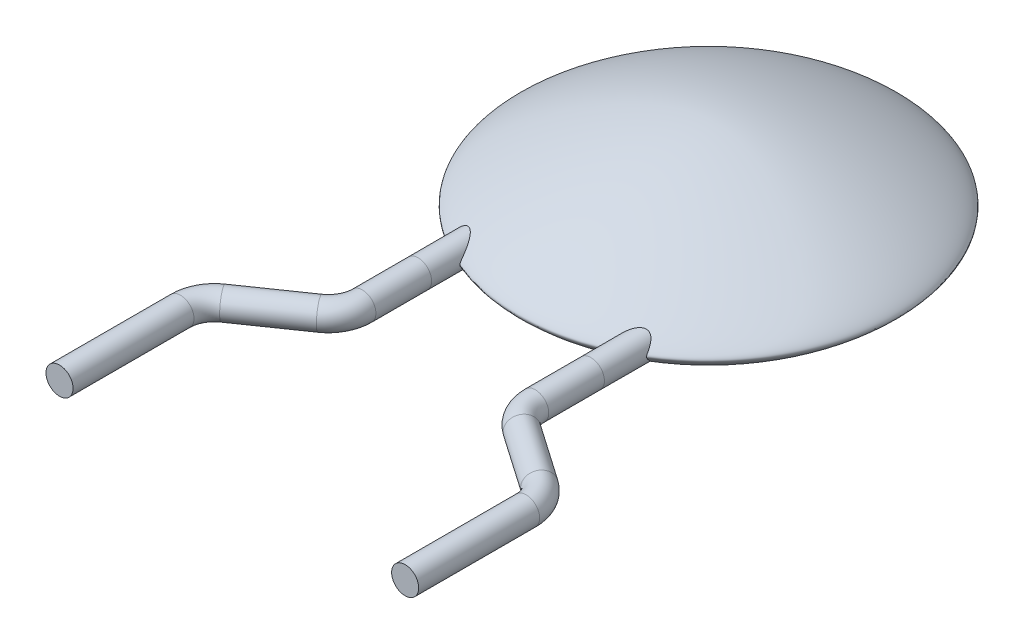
ISO-10303-21;
HEADER;
FILE_DESCRIPTION(('STEP AP214'),'2;1');
FILE_NAME('part.step','',(''),(''),'','','');
FILE_SCHEMA(('AUTOMOTIVE_DESIGN { 1 0 10303 214 1 1 1 1 }'));
ENDSEC;
DATA;
#1=APPLICATION_CONTEXT('core data for automotive mechanical design processes');
#2=APPLICATION_PROTOCOL_DEFINITION('international standard','automotive_design',2000,#1);
#3=PRODUCT_CONTEXT('',#1,'mechanical');
#4=PRODUCT('Part','Part','',(#3));
#5=PRODUCT_RELATED_PRODUCT_CATEGORY('part','',(#4));
#6=PRODUCT_DEFINITION_FORMATION('','',#4);
#7=PRODUCT_DEFINITION_CONTEXT('part definition',#1,'design');
#8=PRODUCT_DEFINITION('design','',#6,#7);
#9=PRODUCT_DEFINITION_SHAPE('','',#8);
#10=(LENGTH_UNIT() NAMED_UNIT(*) SI_UNIT(.MILLI.,.METRE.));
#11=(NAMED_UNIT(*) PLANE_ANGLE_UNIT() SI_UNIT($,.RADIAN.));
#12=(NAMED_UNIT(*) SI_UNIT($,.STERADIAN.) SOLID_ANGLE_UNIT());
#13=UNCERTAINTY_MEASURE_WITH_UNIT(LENGTH_MEASURE(1.E-05),#10,'distance_accuracy_value','');
#14=(GEOMETRIC_REPRESENTATION_CONTEXT(3) GLOBAL_UNCERTAINTY_ASSIGNED_CONTEXT((#13)) GLOBAL_UNIT_ASSIGNED_CONTEXT((#10,
#11,#12)) REPRESENTATION_CONTEXT('',''));
#15=CARTESIAN_POINT('',(0.,0.,0.));
#16=DIRECTION('',(0.,0.,1.));
#17=DIRECTION('',(1.,0.,0.));
#18=AXIS2_PLACEMENT_3D('',#15,#16,#17);
#19=CARTESIAN_POINT('',(0.,1.05,0.));
#20=CARTESIAN_POINT('',(-1.17248497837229,1.04999999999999,0.));
#21=CARTESIAN_POINT('',(-2.8,0.16193282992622,0.));
#22=CARTESIAN_POINT('',(-2.8,-0.16193282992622,0.));
#23=CARTESIAN_POINT('',(-1.2956675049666,-1.05,0.));
#24=CARTESIAN_POINT('',(0.,-1.05,0.));
#25=B_SPLINE_CURVE_WITH_KNOTS('',3,(#19,#20,#21,#22,#23,#24),.UNSPECIFIED.,.F.,.F.,(4,2,4),(0.,
0.5,1.),.UNSPECIFIED.);
#26=CARTESIAN_POINT('',(0.,1.05,0.));
#27=DIRECTION('',(0.,1.,0.));
#28=AXIS1_PLACEMENT('',#26,#27);
#29=SURFACE_OF_REVOLUTION('',#25,#28);
#30=CARTESIAN_POINT('',(1.47000000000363,0.,2.38308623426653));
#31=CARTESIAN_POINT('',(1.46999967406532,0.00371449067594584,2.3830677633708));
#32=CARTESIAN_POINT('',(1.46989144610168,0.007420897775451,2.38215189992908));
#33=CARTESIAN_POINT('',(1.46947322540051,0.0151314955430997,2.3792964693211));
#34=CARTESIAN_POINT('',(1.4691278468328,0.0190516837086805,2.37719144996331));
#35=CARTESIAN_POINT('',(1.46825798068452,0.0266046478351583,2.37252553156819));
#36=CARTESIAN_POINT('',(1.46773279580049,0.0302362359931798,2.36996287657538));
#37=CARTESIAN_POINT('',(1.46605837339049,0.0400254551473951,2.36251611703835));
#38=CARTESIAN_POINT('',(1.46474134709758,0.0459528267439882,2.35737566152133));
#39=CARTESIAN_POINT('',(1.46166454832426,0.0574419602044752,2.34682128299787));
#40=CARTESIAN_POINT('',(1.45990392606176,0.0630029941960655,2.34140685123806));
#41=CARTESIAN_POINT('',(1.45395505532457,0.0793507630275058,2.32499898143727));
#42=CARTESIAN_POINT('',(1.44910577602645,0.0897700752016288,2.31386955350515));
#43=CARTESIAN_POINT('',(1.43739431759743,0.110074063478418,2.29206232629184));
#44=CARTESIAN_POINT('',(1.43052219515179,0.119955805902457,2.28138706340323));
#45=CARTESIAN_POINT('',(1.41430596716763,0.139041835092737,2.2615025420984));
#46=CARTESIAN_POINT('',(1.40498460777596,0.148251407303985,2.25228098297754));
#47=CARTESIAN_POINT('',(1.38506181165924,0.163974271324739,2.23832270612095));
#48=CARTESIAN_POINT('',(1.37501084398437,0.170671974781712,2.23307313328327));
#49=CARTESIAN_POINT('',(1.35835411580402,0.179538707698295,2.22790199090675));
#50=CARTESIAN_POINT('',(1.35249504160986,0.182311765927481,2.2266295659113));
#51=CARTESIAN_POINT('',(1.34041669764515,0.187306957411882,2.22518087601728));
#52=CARTESIAN_POINT('',(1.33419785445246,0.189529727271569,2.22500333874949));
#53=CARTESIAN_POINT('',(1.32233866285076,0.193118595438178,2.2257422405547));
#54=CARTESIAN_POINT('',(1.31671079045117,0.194552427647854,2.22653934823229));
#55=CARTESIAN_POINT('',(1.30551924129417,0.196904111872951,2.22895871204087));
#56=CARTESIAN_POINT('',(1.29995570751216,0.197820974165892,2.23058253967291));
#57=CARTESIAN_POINT('',(1.28005556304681,0.200274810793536,2.23777048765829));
#58=CARTESIAN_POINT('',(1.26629751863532,0.200362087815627,2.24542884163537));
#59=CARTESIAN_POINT('',(1.24324630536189,0.19848203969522,2.26155224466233));
#60=CARTESIAN_POINT('',(1.23359562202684,0.196883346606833,2.26962107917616));
#61=CARTESIAN_POINT('',(1.21542939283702,0.192633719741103,2.2867414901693));
#62=CARTESIAN_POINT('',(1.20691674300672,0.189980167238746,2.29579547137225));
#63=CARTESIAN_POINT('',(1.18374390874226,0.181178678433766,2.3227804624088));
#64=CARTESIAN_POINT('',(1.17034619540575,0.174021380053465,2.34144767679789));
#65=CARTESIAN_POINT('',(1.14616991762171,0.157723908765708,2.37960538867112));
#66=CARTESIAN_POINT('',(1.13540091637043,0.148576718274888,2.39909859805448));
#67=CARTESIAN_POINT('',(1.11509610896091,0.127449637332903,2.44037694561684));
#68=CARTESIAN_POINT('',(1.10581030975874,0.115272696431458,2.46218689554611));
#69=CARTESIAN_POINT('',(1.09389818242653,0.0951199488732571,2.49440971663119));
#70=CARTESIAN_POINT('',(1.09026576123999,0.0880944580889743,2.50505995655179));
#71=CARTESIAN_POINT('',(1.08371435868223,0.0732419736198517,2.52600950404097));
#72=CARTESIAN_POINT('',(1.08079413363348,0.0654164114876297,2.53630939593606));
#73=CARTESIAN_POINT('',(1.07695482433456,0.0524892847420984,2.55144772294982));
#74=CARTESIAN_POINT('',(1.07573914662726,0.047829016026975,2.5565842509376));
#75=CARTESIAN_POINT('',(1.07358552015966,0.0380358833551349,2.56641055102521));
#76=CARTESIAN_POINT('',(1.07264620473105,0.0329055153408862,2.57110244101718));
#77=CARTESIAN_POINT('',(1.07134379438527,0.0234759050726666,2.57832353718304));
#78=CARTESIAN_POINT('',(1.07089242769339,0.0193812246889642,2.58108151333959));
#79=CARTESIAN_POINT('',(1.07043460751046,0.013287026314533,2.5841588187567));
#80=CARTESIAN_POINT('',(1.07032479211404,0.011535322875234,2.58493876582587));
#81=CARTESIAN_POINT('',(1.07014974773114,0.00794304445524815,2.58624351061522));
#82=CARTESIAN_POINT('',(1.07008425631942,0.00610306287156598,2.58676980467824));
#83=CARTESIAN_POINT('',(1.07001359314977,0.00275389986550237,2.58735975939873));
#84=CARTESIAN_POINT('',(1.0699984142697,0.00125960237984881,2.58749904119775));
#85=CARTESIAN_POINT('',(1.07000185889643,-0.0017270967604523,2.58747686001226));
#86=CARTESIAN_POINT('',(1.07002052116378,-0.00321949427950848,2.58731505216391));
#87=CARTESIAN_POINT('',(1.07010547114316,-0.00684279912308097,2.58665719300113));
#88=CARTESIAN_POINT('',(1.07018981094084,-0.00894936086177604,2.58604106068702));
#89=CARTESIAN_POINT('',(1.07041594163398,-0.0130559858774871,2.58451471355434));
#90=CARTESIAN_POINT('',(1.0705580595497,-0.0150553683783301,2.58360283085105));
#91=CARTESIAN_POINT('',(1.07118369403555,-0.0223954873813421,2.57982222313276));
#92=CARTESIAN_POINT('',(1.07182673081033,-0.0273977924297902,2.57634290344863));
#93=CARTESIAN_POINT('',(1.07337429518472,-0.0368965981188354,2.56882704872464));
#94=CARTESIAN_POINT('',(1.07427990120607,-0.0413909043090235,2.56478825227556));
#95=CARTESIAN_POINT('',(1.07689696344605,-0.0525418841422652,2.55395847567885));
#96=CARTESIAN_POINT('',(1.07877067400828,-0.0589347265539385,2.54693376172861));
#97=CARTESIAN_POINT('',(1.08296877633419,-0.0711381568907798,2.53251689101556));
#98=CARTESIAN_POINT('',(1.08529412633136,-0.0769474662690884,2.52512397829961));
#99=CARTESIAN_POINT('',(1.09289308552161,-0.0937284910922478,2.50260626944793));
#100=CARTESIAN_POINT('',(1.09878018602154,-0.104017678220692,2.48718145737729));
#101=CARTESIAN_POINT('',(1.11571571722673,-0.128553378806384,2.44757864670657));
#102=CARTESIAN_POINT('',(1.1278210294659,-0.141858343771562,2.42325865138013));
#103=CARTESIAN_POINT('',(1.14889420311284,-0.159420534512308,2.38744991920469));
#104=CARTESIAN_POINT('',(1.15638184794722,-0.164864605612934,2.37565457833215));
#105=CARTESIAN_POINT('',(1.17246484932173,-0.174862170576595,2.3524579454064));
#106=CARTESIAN_POINT('',(1.18105958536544,-0.179416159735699,2.34105643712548));
#107=CARTESIAN_POINT('',(1.20245860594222,-0.188719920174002,2.31542838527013));
#108=CARTESIAN_POINT('',(1.21573949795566,-0.193087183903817,2.30143076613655));
#109=CARTESIAN_POINT('',(1.23785298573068,-0.197541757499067,2.28227030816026));
#110=CARTESIAN_POINT('',(1.24563867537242,-0.198677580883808,2.27616094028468));
#111=CARTESIAN_POINT('',(1.2619611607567,-0.200008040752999,2.26495020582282));
#112=CARTESIAN_POINT('',(1.27049599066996,-0.200205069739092,2.25984630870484));
#113=CARTESIAN_POINT('',(1.29106674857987,-0.199220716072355,2.24981534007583));
#114=CARTESIAN_POINT('',(1.30337730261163,-0.19760124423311,2.24541555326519));
#115=CARTESIAN_POINT('',(1.32200782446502,-0.193228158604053,2.24175942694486));
#116=CARTESIAN_POINT('',(1.32827702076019,-0.191432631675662,2.24103517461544));
#117=CARTESIAN_POINT('',(1.34064007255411,-0.187223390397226,2.24063623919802));
#118=CARTESIAN_POINT('',(1.34673393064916,-0.184809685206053,2.24096154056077));
#119=CARTESIAN_POINT('',(1.36333291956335,-0.177272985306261,2.24329652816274));
#120=CARTESIAN_POINT('',(1.37340387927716,-0.171541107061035,2.24645906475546));
#121=CARTESIAN_POINT('',(1.39679225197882,-0.155646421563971,2.25743180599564));
#122=CARTESIAN_POINT('',(1.4088013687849,-0.1447919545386,2.26684846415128));
#123=CARTESIAN_POINT('',(1.42758368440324,-0.12383576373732,2.28631127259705));
#124=CARTESIAN_POINT('',(1.43486726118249,-0.113858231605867,2.29606099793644));
#125=CARTESIAN_POINT('',(1.44731853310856,-0.0932863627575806,2.31620778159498));
#126=CARTESIAN_POINT('',(1.45248991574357,-0.0826931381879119,2.32660367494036));
#127=CARTESIAN_POINT('',(1.4584793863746,-0.0670758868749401,2.34112770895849));
#128=CARTESIAN_POINT('',(1.46007249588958,-0.062426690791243,2.3453582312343));
#129=CARTESIAN_POINT('',(1.46294836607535,-0.052877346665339,2.35370298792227));
#130=CARTESIAN_POINT('',(1.46422918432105,-0.0479758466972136,2.35781636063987));
#131=CARTESIAN_POINT('',(1.46647252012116,-0.037769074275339,2.3657990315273));
#132=CARTESIAN_POINT('',(1.46742991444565,-0.0324588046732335,2.36966368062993));
#133=CARTESIAN_POINT('',(1.46856250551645,-0.0240956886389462,2.37484731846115));
#134=CARTESIAN_POINT('',(1.46888858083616,-0.0212566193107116,2.37646649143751));
#135=CARTESIAN_POINT('',(1.46942805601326,-0.0154020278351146,2.37935633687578));
#136=CARTESIAN_POINT('',(1.46964161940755,-0.0123867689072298,2.38062751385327));
#137=CARTESIAN_POINT('',(1.46992461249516,-0.00623777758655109,2.38248569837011));
#138=CARTESIAN_POINT('',(1.47000027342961,-0.00311604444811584,2.3831017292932));
#139=CARTESIAN_POINT('',(1.47000000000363,0.,2.38308623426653));
#140=B_SPLINE_CURVE_WITH_KNOTS('',3,(#30,#31,#32,#33,#34,#35,#36,#37,#38,#39,#40,#41,#42,#43,
#44,#45,#46,#47,#48,#49,#50,#51,#52,#53,#54,#55,#56,#57,#58,#59,#60,#61,#62,#63,#64,#65,#66,#67,
#68,#69,#70,#71,#72,#73,#74,#75,#76,#77,#78,#79,#80,#81,#82,#83,#84,#85,#86,#87,#88,#89,#90,#91,
#92,#93,#94,#95,#96,#97,#98,#99,#100,#101,#102,#103,#104,#105,#106,#107,#108,#109,#110,#111,
#112,#113,#114,#115,#116,#117,#118,#119,#120,#121,#122,#123,#124,#125,#126,#127,#128,#129,#130,
#131,#132,#133,#134,#135,#136,#137,#138,#139),.UNSPECIFIED.,.T.,.F.,(4,2,2,2,2,2,2,2,2,2,2,2,2,
2,2,2,2,2,2,2,2,2,2,2,2,2,2,2,2,2,2,2,2,2,2,2,2,2,2,2,2,2,2,2,2,2,2,2,2,2,2,2,2,2,4),(0.,
0.0111621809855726,0.0245119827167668,0.0379141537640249,0.0617319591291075,0.0855957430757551,
0.13345252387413,0.181548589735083,0.22921287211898,0.268113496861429,0.287822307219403,
0.307508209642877,0.325007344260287,0.342539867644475,0.388830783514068,0.426752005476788,
0.464767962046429,0.536579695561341,0.608648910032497,0.688322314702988,0.728092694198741,
0.767793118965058,0.788895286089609,0.809891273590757,0.824662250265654,0.830411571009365,
0.836126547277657,0.840601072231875,0.845080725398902,0.851634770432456,0.858226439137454,
0.876465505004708,0.894780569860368,0.92375500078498,0.952791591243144,1.01102420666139,
1.1013290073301,1.14625445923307,1.19115484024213,1.25006902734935,1.27985687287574,
1.3095687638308,1.34832979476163,1.36790587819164,1.38748167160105,1.42294649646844,
1.47812988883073,1.52519474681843,1.57217708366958,1.59162290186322,1.61118675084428,
1.63104737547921,1.64088142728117,1.65070114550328,1.66006497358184),.UNSPECIFIED.);
#141=CARTESIAN_POINT('',(1.47000000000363,0.,2.38308623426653));
#142=VERTEX_POINT('',#141);
#143=EDGE_CURVE('E11',#142,#142,#140,.T.);
#144=ORIENTED_EDGE('',*,*,#143,.F.);
#145=EDGE_LOOP('',(#144));
#146=FACE_BOUND('',#145,.T.);
#147=CARTESIAN_POINT('',(-1.07000000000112,0.,2.58748913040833));
#148=CARTESIAN_POINT('',(-1.07000007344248,0.0035103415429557,2.5874711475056));
#149=CARTESIAN_POINT('',(-1.0700971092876,0.00702169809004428,2.58662128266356));
#150=CARTESIAN_POINT('',(-1.07041537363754,0.0132211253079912,2.58427957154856));
#151=CARTESIAN_POINT('',(-1.07061950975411,0.0159572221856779,2.58288155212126));
#152=CARTESIAN_POINT('',(-1.07111315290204,0.0212332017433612,2.57975653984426));
#153=CARTESIAN_POINT('',(-1.07140274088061,0.0237728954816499,2.5780292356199));
#154=CARTESIAN_POINT('',(-1.07226853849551,0.0303236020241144,2.57315774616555));
#155=CARTESIAN_POINT('',(-1.07290725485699,0.0341892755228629,2.56983549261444));
#156=CARTESIAN_POINT('',(-1.07434210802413,0.0416192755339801,2.56289663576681));
#157=CARTESIAN_POINT('',(-1.07513856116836,0.0451829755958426,2.55927944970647));
#158=CARTESIAN_POINT('',(-1.07773991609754,0.0555649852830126,2.54812605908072));
#159=CARTESIAN_POINT('',(-1.07975131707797,0.0620379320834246,2.54031912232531));
#160=CARTESIAN_POINT('',(-1.08525949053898,0.0772174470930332,2.52073450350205));
#161=CARTESIAN_POINT('',(-1.08901458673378,0.0855886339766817,2.50877634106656));
#162=CARTESIAN_POINT('',(-1.09740659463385,0.101446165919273,2.48456948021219));
#163=CARTESIAN_POINT('',(-1.1020450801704,0.108930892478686,2.47232029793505));
#164=CARTESIAN_POINT('',(-1.11722017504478,0.130250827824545,2.4354907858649));
#165=CARTESIAN_POINT('',(-1.12903259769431,0.142993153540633,2.41077014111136));
#166=CARTESIAN_POINT('',(-1.15111463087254,0.161189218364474,2.3716400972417));
#167=CARTESIAN_POINT('',(-1.16019345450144,0.167548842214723,2.35696443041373));
#168=CARTESIAN_POINT('',(-1.1800307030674,0.178990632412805,2.32826965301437));
#169=CARTESIAN_POINT('',(-1.19078525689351,0.184075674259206,2.31424912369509));
#170=CARTESIAN_POINT('',(-1.20970824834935,0.190843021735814,2.29283846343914));
#171=CARTESIAN_POINT('',(-1.21719947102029,0.193073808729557,2.28503256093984));
#172=CARTESIAN_POINT('',(-1.23305361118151,0.196728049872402,2.27017658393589));
#173=CARTESIAN_POINT('',(-1.24141557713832,0.19815237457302,2.2631257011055));
#174=CARTESIAN_POINT('',(-1.26267378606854,0.200246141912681,2.24767217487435));
#175=CARTESIAN_POINT('',(-1.27607419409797,0.200411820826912,2.23979865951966));
#176=CARTESIAN_POINT('',(-1.29575451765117,0.198413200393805,2.23197621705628));
#177=CARTESIAN_POINT('',(-1.30141339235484,0.197603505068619,2.23011909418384));
#178=CARTESIAN_POINT('',(-1.31283467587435,0.195445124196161,2.22724673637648));
#179=CARTESIAN_POINT('',(-1.3185968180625,0.194097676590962,2.22622958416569));
#180=CARTESIAN_POINT('',(-1.33008757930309,0.190853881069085,2.22512623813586));
#181=CARTESIAN_POINT('',(-1.33581591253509,0.188954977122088,2.22504445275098));
#182=CARTESIAN_POINT('',(-1.34702183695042,0.184672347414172,2.22581464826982));
#183=CARTESIAN_POINT('',(-1.35249926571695,0.182288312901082,2.22666722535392));
#184=CARTESIAN_POINT('',(-1.37002044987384,0.1737242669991,2.23089411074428));
#185=CARTESIAN_POINT('',(-1.38120637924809,0.166681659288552,2.23611093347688));
#186=CARTESIAN_POINT('',(-1.39868029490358,0.15341313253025,2.24759147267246));
#187=CARTESIAN_POINT('',(-1.40550348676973,0.147367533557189,2.25334470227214));
#188=CARTESIAN_POINT('',(-1.41791099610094,0.134902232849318,2.26577636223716));
#189=CARTESIAN_POINT('',(-1.42349014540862,0.128481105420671,2.27245847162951));
#190=CARTESIAN_POINT('',(-1.43761563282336,0.110135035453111,2.29190207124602));
#191=CARTESIAN_POINT('',(-1.44496408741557,0.0979173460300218,2.30524975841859));
#192=CARTESIAN_POINT('',(-1.45393400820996,0.0788432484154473,2.32535242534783));
#193=CARTESIAN_POINT('',(-1.45658005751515,0.0723681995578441,2.3320593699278));
#194=CARTESIAN_POINT('',(-1.46122101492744,0.0590332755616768,2.3453124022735));
#195=CARTESIAN_POINT('',(-1.46321698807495,0.0521740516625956,2.35185873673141));
#196=CARTESIAN_POINT('',(-1.46549465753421,0.0422994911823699,2.36042809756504));
#197=CARTESIAN_POINT('',(-1.4660657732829,0.0395751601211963,2.36271014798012));
#198=CARTESIAN_POINT('',(-1.4671106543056,0.0339931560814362,2.36714635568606));
#199=CARTESIAN_POINT('',(-1.46758417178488,0.0311351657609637,2.36930017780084));
#200=CARTESIAN_POINT('',(-1.46842632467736,0.025218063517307,2.37340341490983));
#201=CARTESIAN_POINT('',(-1.46879397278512,0.0221573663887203,2.37535080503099));
#202=CARTESIAN_POINT('',(-1.46939989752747,0.0158115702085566,2.3788471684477));
#203=CARTESIAN_POINT('',(-1.46963868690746,0.012527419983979,2.38039770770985));
#204=CARTESIAN_POINT('',(-1.469931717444,0.00601419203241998,2.38247631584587));
#205=CARTESIAN_POINT('',(-1.47000501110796,0.00282782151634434,2.38310651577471));
#206=CARTESIAN_POINT('',(-1.46999436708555,-0.00353345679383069,2.38306083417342));
#207=CARTESIAN_POINT('',(-1.46991006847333,-0.00670832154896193,2.38238195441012));
#208=CARTESIAN_POINT('',(-1.46956313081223,-0.0138448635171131,2.38012817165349));
#209=CARTESIAN_POINT('',(-1.46925001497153,-0.0177116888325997,2.37832858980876));
#210=CARTESIAN_POINT('',(-1.46844336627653,-0.0251832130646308,2.37425653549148));
#211=CARTESIAN_POINT('',(-1.4679489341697,-0.0287864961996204,2.37198173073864));
#212=CARTESIAN_POINT('',(-1.46639794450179,-0.0382737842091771,2.36549642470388));
#213=CARTESIAN_POINT('',(-1.46519107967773,-0.0439696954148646,2.36105420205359));
#214=CARTESIAN_POINT('',(-1.46236424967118,-0.0550296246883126,2.35189177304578));
#215=CARTESIAN_POINT('',(-1.46074350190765,-0.0603929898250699,2.34717105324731));
#216=CARTESIAN_POINT('',(-1.45526780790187,-0.0761632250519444,2.33284257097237));
#217=CARTESIAN_POINT('',(-1.45080312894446,-0.0862293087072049,2.32308526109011));
#218=CARTESIAN_POINT('',(-1.44008619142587,-0.105803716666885,2.30396115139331));
#219=CARTESIAN_POINT('',(-1.43383178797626,-0.115311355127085,2.29459483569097));
#220=CARTESIAN_POINT('',(-1.4192140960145,-0.133691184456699,2.27704162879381));
#221=CARTESIAN_POINT('',(-1.410864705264,-0.142567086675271,2.2688475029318));
#222=CARTESIAN_POINT('',(-1.39194139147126,-0.158985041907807,2.25512818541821));
#223=CARTESIAN_POINT('',(-1.38149964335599,-0.166571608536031,2.24948998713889));
#224=CARTESIAN_POINT('',(-1.36404222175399,-0.176641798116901,2.24386275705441));
#225=CARTESIAN_POINT('',(-1.35787575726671,-0.179797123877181,2.24245903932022));
#226=CARTESIAN_POINT('',(-1.34511579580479,-0.185488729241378,2.24081779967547));
#227=CARTESIAN_POINT('',(-1.33852288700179,-0.188025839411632,2.24057870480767));
#228=CARTESIAN_POINT('',(-1.32599435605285,-0.192100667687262,2.24127714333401));
#229=CARTESIAN_POINT('',(-1.32007765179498,-0.19372293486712,2.24207354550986));
#230=CARTESIAN_POINT('',(-1.30828988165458,-0.196393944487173,2.24453539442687));
#231=CARTESIAN_POINT('',(-1.30241892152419,-0.197441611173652,2.24620245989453));
#232=CARTESIAN_POINT('',(-1.28173036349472,-0.200220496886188,2.25350546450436));
#233=CARTESIAN_POINT('',(-1.26744793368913,-0.200412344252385,2.26124858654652));
#234=CARTESIAN_POINT('',(-1.24367210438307,-0.19855059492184,2.27745974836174));
#235=CARTESIAN_POINT('',(-1.23378903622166,-0.196930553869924,2.28548682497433));
#236=CARTESIAN_POINT('',(-1.21515593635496,-0.192567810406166,2.30252755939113));
#237=CARTESIAN_POINT('',(-1.20640842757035,-0.189822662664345,2.31154333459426));
#238=CARTESIAN_POINT('',(-1.18312391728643,-0.180872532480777,2.33781449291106));
#239=CARTESIAN_POINT('',(-1.16974665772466,-0.173679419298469,2.35574476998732));
#240=CARTESIAN_POINT('',(-1.14553449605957,-0.157230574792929,2.39241632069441));
#241=CARTESIAN_POINT('',(-1.13471256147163,-0.147964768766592,2.41116118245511));
#242=CARTESIAN_POINT('',(-1.11441541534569,-0.126617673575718,2.45059864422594));
#243=CARTESIAN_POINT('',(-1.10516153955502,-0.114353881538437,2.47130911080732));
#244=CARTESIAN_POINT('',(-1.09332884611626,-0.0940585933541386,2.50176087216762));
#245=CARTESIAN_POINT('',(-1.08973506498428,-0.0870050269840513,2.51177494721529));
#246=CARTESIAN_POINT('',(-1.08326526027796,-0.0720900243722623,2.53142049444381));
#247=CARTESIAN_POINT('',(-1.08038778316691,-0.0642302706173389,2.54105270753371));
#248=CARTESIAN_POINT('',(-1.0769994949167,-0.0525524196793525,2.5537225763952));
#249=CARTESIAN_POINT('',(-1.07612835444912,-0.0492540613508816,2.55714222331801));
#250=CARTESIAN_POINT('',(-1.07451779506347,-0.0424169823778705,2.56380074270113));
#251=CARTESIAN_POINT('',(-1.07377897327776,-0.038877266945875,2.56703875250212));
#252=CARTESIAN_POINT('',(-1.07245180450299,-0.0314491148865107,2.57323383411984));
#253=CARTESIAN_POINT('',(-1.07186542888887,-0.0275569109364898,2.57618694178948));
#254=CARTESIAN_POINT('',(-1.07089676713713,-0.0193698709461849,2.58148352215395));
#255=CARTESIAN_POINT('',(-1.07051327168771,-0.0150776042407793,2.58383056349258));
#256=CARTESIAN_POINT('',(-1.07009863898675,-0.00708540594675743,2.58667789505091));
#257=CARTESIAN_POINT('',(-1.06999992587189,-0.00354322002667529,2.58750728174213));
#258=CARTESIAN_POINT('',(-1.07000000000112,0.,2.58748913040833));
#259=B_SPLINE_CURVE_WITH_KNOTS('',3,(#147,#148,#149,#150,#151,#152,#153,#154,#155,#156,#157,
#158,#159,#160,#161,#162,#163,#164,#165,#166,#167,#168,#169,#170,#171,#172,#173,#174,#175,#176,
#177,#178,#179,#180,#181,#182,#183,#184,#185,#186,#187,#188,#189,#190,#191,#192,#193,#194,#195,
#196,#197,#198,#199,#200,#201,#202,#203,#204,#205,#206,#207,#208,#209,#210,#211,#212,#213,#214,
#215,#216,#217,#218,#219,#220,#221,#222,#223,#224,#225,#226,#227,#228,#229,#230,#231,#232,#233,
#234,#235,#236,#237,#238,#239,#240,#241,#242,#243,#244,#245,#246,#247,#248,#249,#250,#251,#252,
#253,#254,#255,#256,#257,#258),.UNSPECIFIED.,.T.,.F.,(4,2,2,2,2,2,2,2,2,2,2,2,2,2,2,2,2,2,2,2,2,
2,2,2,2,2,2,2,2,2,2,2,2,2,2,2,2,2,2,2,2,2,2,2,2,2,2,2,2,2,2,2,2,2,2,4),(0.,0.010546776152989,
0.019771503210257,0.0290049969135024,0.0443819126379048,0.0597899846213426,0.0907492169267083,
0.135892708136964,0.181117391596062,0.271348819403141,0.326439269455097,0.381404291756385,
0.414466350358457,0.447492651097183,0.493269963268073,0.511231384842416,0.529151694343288,
0.54715642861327,0.565172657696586,0.606928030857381,0.639155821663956,0.671515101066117,
0.729767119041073,0.758828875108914,0.787842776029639,0.798637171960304,0.809458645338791,
0.820377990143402,0.831253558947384,0.840794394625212,0.850357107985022,0.863138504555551,
0.875984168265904,0.897909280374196,0.919876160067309,0.963890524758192,1.00795786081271,
1.05174025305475,1.09333245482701,1.11441723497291,1.13547352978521,1.15393946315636,
1.17243985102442,1.22019892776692,1.25857921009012,1.29704335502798,1.36716149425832,
1.43762816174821,1.51470036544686,1.55296795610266,1.59115724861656,1.60564057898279,
1.62018770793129,1.63491452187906,1.64955253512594,1.66019809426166),.UNSPECIFIED.);
#260=CARTESIAN_POINT('',(-1.07000000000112,0.,2.58748913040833));
#261=VERTEX_POINT('',#260);
#262=EDGE_CURVE('E44',#261,#261,#259,.T.);
#263=ORIENTED_EDGE('',*,*,#262,.F.);
#264=EDGE_LOOP('',(#263));
#265=FACE_BOUND('',#264,.T.);
#266=CARTESIAN_POINT('',(0.,-1.05,0.));
#267=VERTEX_POINT('',#266);
#268=VERTEX_LOOP('',#267);
#269=FACE_BOUND('',#268,.T.);
#270=CARTESIAN_POINT('',(0.,1.05,0.));
#271=VERTEX_POINT('',#270);
#272=VERTEX_LOOP('',#271);
#273=FACE_BOUND('',#272,.T.);
#274=ADVANCED_FACE('F32',(#146,#265,#269,#273),#29,.F.);
#275=CARTESIAN_POINT('',(-1.27,0.,-500000.));
#276=DIRECTION('',(0.,0.,1.));
#277=DIRECTION('',(1.,0.,0.));
#278=AXIS2_PLACEMENT_3D('',#275,#276,#277);
#279=CYLINDRICAL_SURFACE('',#278,0.2);
#280=ORIENTED_EDGE('',*,*,#262,.T.);
#281=EDGE_LOOP('',(#280));
#282=FACE_BOUND('',#281,.T.);
#283=CARTESIAN_POINT('',(-1.27,0.,3.));
#284=DIRECTION('',(0.,0.,1.));
#285=DIRECTION('',(1.,0.,0.));
#286=AXIS2_PLACEMENT_3D('',#283,#284,#285);
#287=CIRCLE('',#286,0.199);
#288=CARTESIAN_POINT('',(-1.071,0.,3.));
#289=VERTEX_POINT('',#288);
#290=EDGE_CURVE('E63',#289,#289,#287,.T.);
#291=ORIENTED_EDGE('',*,*,#290,.F.);
#292=EDGE_LOOP('',(#291));
#293=FACE_BOUND('',#292,.T.);
#294=ADVANCED_FACE('F52',(#282,#293),#279,.T.);
#295=CARTESIAN_POINT('',(1.27,0.,-500000.));
#296=DIRECTION('',(0.,0.,1.));
#297=DIRECTION('',(1.,0.,0.));
#298=AXIS2_PLACEMENT_3D('',#295,#296,#297);
#299=CYLINDRICAL_SURFACE('',#298,0.2);
#300=ORIENTED_EDGE('',*,*,#143,.T.);
#301=EDGE_LOOP('',(#300));
#302=FACE_BOUND('',#301,.T.);
#303=CARTESIAN_POINT('',(1.27,0.,3.));
#304=DIRECTION('',(0.,0.,1.));
#305=DIRECTION('',(-1.,0.,0.));
#306=AXIS2_PLACEMENT_3D('',#303,#304,#305);
#307=CIRCLE('',#306,0.199);
#308=CARTESIAN_POINT('',(1.071,0.,3.));
#309=VERTEX_POINT('',#308);
#310=EDGE_CURVE('E66',#309,#309,#307,.T.);
#311=ORIENTED_EDGE('',*,*,#310,.F.);
#312=EDGE_LOOP('',(#311));
#313=FACE_BOUND('',#312,.T.);
#314=ADVANCED_FACE('F57',(#302,#313),#299,.T.);
#315=CARTESIAN_POINT('',(-2.54,0.,5.22237451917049));
#316=DIRECTION('',(0.,0.,1.));
#317=DIRECTION('',(1.,0.,0.));
#318=AXIS2_PLACEMENT_3D('',#315,#316,#317);
#319=CYLINDRICAL_SURFACE('',#318,0.199);
#320=CARTESIAN_POINT('',(-2.54,0.,5.22237451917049));
#321=DIRECTION('',(0.,0.,1.));
#322=DIRECTION('',(1.,0.,0.));
#323=AXIS2_PLACEMENT_3D('',#320,#321,#322);
#324=CIRCLE('',#323,0.199);
#325=CARTESIAN_POINT('',(-2.739,0.,5.22237451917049));
#326=VERTEX_POINT('',#325);
#327=EDGE_CURVE('E96',#326,#326,#324,.T.);
#328=ORIENTED_EDGE('',*,*,#327,.T.);
#329=EDGE_LOOP('',(#328));
#330=FACE_BOUND('',#329,.T.);
#331=CARTESIAN_POINT('',(-2.54,0.,7.));
#332=DIRECTION('',(0.,0.,1.));
#333=DIRECTION('',(1.,0.,0.));
#334=AXIS2_PLACEMENT_3D('',#331,#332,#333);
#335=CIRCLE('',#334,0.199);
#336=CARTESIAN_POINT('',(-2.341,0.,7.));
#337=VERTEX_POINT('',#336);
#338=EDGE_CURVE('E94',#337,#337,#335,.T.);
#339=ORIENTED_EDGE('',*,*,#338,.F.);
#340=EDGE_LOOP('',(#339));
#341=FACE_BOUND('',#340,.T.);
#342=ADVANCED_FACE('F132',(#330,#341),#319,.T.);
#343=CARTESIAN_POINT('',(-2.04,0.,5.22237451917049));
#344=DIRECTION('',(0.,1.,0.));
#345=DIRECTION('',(0.,0.,1.));
#346=AXIS2_PLACEMENT_3D('',#343,#344,#345);
#347=TOROIDAL_SURFACE('',#346,0.500000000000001,0.199);
#348=CARTESIAN_POINT('',(-2.32486617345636,0.,4.81145936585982));
#349=DIRECTION('',(-0.821830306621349,0.,0.569732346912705));
#350=DIRECTION('',(0.569732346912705,0.,0.821830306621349));
#351=AXIS2_PLACEMENT_3D('',#348,#349,#350);
#352=CIRCLE('',#351,0.199);
#353=CARTESIAN_POINT('',(-2.43824291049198,0.,4.64791513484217));
#354=VERTEX_POINT('',#353);
#355=EDGE_CURVE('E101',#354,#354,#352,.T.);
#356=CARTESIAN_POINT('',(-2.04,0.,5.22237451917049));
#357=DIRECTION('',(0.,1.,0.));
#358=DIRECTION('',(0.,0.,1.));
#359=AXIS2_PLACEMENT_3D('',#356,#357,#358);
#360=CIRCLE('',#359,0.699000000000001);
#361=EDGE_CURVE('',#354,#326,#360,.T.);
#362=ORIENTED_EDGE('',*,*,#355,.T.);
#363=ORIENTED_EDGE('',*,*,#327,.F.);
#364=ORIENTED_EDGE('',*,*,#361,.T.);
#365=ORIENTED_EDGE('',*,*,#361,.F.);
#366=EDGE_LOOP('',(#362,#364,#363,#365));
#367=FACE_BOUND('',#366,.T.);
#368=ADVANCED_FACE('F129',(#367),#347,.T.);
#369=CARTESIAN_POINT('',(-1.48513382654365,0.,4.22931646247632));
#370=DIRECTION('',(-0.821830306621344,0.,0.569732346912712));
#371=DIRECTION('',(0.569732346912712,0.,0.821830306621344));
#372=AXIS2_PLACEMENT_3D('',#369,#370,#371);
#373=CYLINDRICAL_SURFACE('',#372,0.199);
#374=CARTESIAN_POINT('',(-1.48513382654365,0.,4.22931646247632));
#375=DIRECTION('',(-0.821830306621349,0.,0.569732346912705));
#376=DIRECTION('',(0.569732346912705,0.,0.821830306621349));
#377=AXIS2_PLACEMENT_3D('',#374,#375,#376);
#378=CIRCLE('',#377,0.199);
#379=CARTESIAN_POINT('',(-1.37175708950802,0.,4.39286069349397));
#380=VERTEX_POINT('',#379);
#381=EDGE_CURVE('E264',#380,#380,#378,.T.);
#382=ORIENTED_EDGE('',*,*,#381,.T.);
#383=EDGE_LOOP('',(#382));
#384=FACE_BOUND('',#383,.T.);
#385=ORIENTED_EDGE('',*,*,#355,.F.);
#386=EDGE_LOOP('',(#385));
#387=FACE_BOUND('',#386,.T.);
#388=ADVANCED_FACE('F125',(#384,#387),#373,.T.);
#389=CARTESIAN_POINT('',(-1.77,0.,3.81840130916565));
#390=DIRECTION('',(0.,-1.,0.));
#391=DIRECTION('',(0.,0.,-1.));
#392=AXIS2_PLACEMENT_3D('',#389,#390,#391);
#393=TOROIDAL_SURFACE('',#392,0.5,0.199);
#394=CARTESIAN_POINT('',(-1.27,0.,3.81840130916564));
#395=DIRECTION('',(0.,0.,1.));
#396=DIRECTION('',(1.,0.,0.));
#397=AXIS2_PLACEMENT_3D('',#394,#395,#396);
#398=CIRCLE('',#397,0.199);
#399=CARTESIAN_POINT('',(-1.071,0.,3.81840130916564));
#400=VERTEX_POINT('',#399);
#401=EDGE_CURVE('E256',#400,#400,#398,.T.);
#402=CARTESIAN_POINT('',(-1.77,0.,3.81840130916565));
#403=DIRECTION('',(0.,-1.,0.));
#404=DIRECTION('',(0.,0.,-1.));
#405=AXIS2_PLACEMENT_3D('',#402,#403,#404);
#406=CIRCLE('',#405,0.699);
#407=EDGE_CURVE('',#400,#380,#406,.T.);
#408=ORIENTED_EDGE('',*,*,#401,.T.);
#409=ORIENTED_EDGE('',*,*,#381,.F.);
#410=ORIENTED_EDGE('',*,*,#407,.T.);
#411=ORIENTED_EDGE('',*,*,#407,.F.);
#412=EDGE_LOOP('',(#408,#410,#409,#411));
#413=FACE_BOUND('',#412,.T.);
#414=ADVANCED_FACE('F120',(#413),#393,.T.);
#415=CARTESIAN_POINT('',(-1.27,0.,3.81840130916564));
#416=DIRECTION('',(0.,0.,-1.));
#417=DIRECTION('',(-1.,0.,0.));
#418=AXIS2_PLACEMENT_3D('',#415,#416,#417);
#419=CYLINDRICAL_SURFACE('',#418,0.199);
#420=ORIENTED_EDGE('',*,*,#401,.F.);
#421=EDGE_LOOP('',(#420));
#422=FACE_BOUND('',#421,.T.);
#423=ORIENTED_EDGE('',*,*,#290,.T.);
#424=EDGE_LOOP('',(#423));
#425=FACE_BOUND('',#424,.T.);
#426=ADVANCED_FACE('F109',(#422,#425),#419,.T.);
#427=CARTESIAN_POINT('',(-2.54,0.,7.));
#428=DIRECTION('',(0.,0.,1.));
#429=DIRECTION('',(1.,0.,0.));
#430=AXIS2_PLACEMENT_3D('',#427,#428,#429);
#431=PLANE('',#430);
#432=ORIENTED_EDGE('',*,*,#338,.T.);
#433=EDGE_LOOP('',(#432));
#434=FACE_BOUND('',#433,.T.);
#435=ADVANCED_FACE('F119',(#434),#431,.T.);
#436=CARTESIAN_POINT('',(2.54,0.,5.22237451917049));
#437=DIRECTION('',(0.,0.,1.));
#438=DIRECTION('',(1.,0.,0.));
#439=AXIS2_PLACEMENT_3D('',#436,#437,#438);
#440=CYLINDRICAL_SURFACE('',#439,0.199);
#441=CARTESIAN_POINT('',(2.54,0.,5.22237451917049));
#442=DIRECTION('',(0.,0.,-1.));
#443=DIRECTION('',(-1.,0.,0.));
#444=AXIS2_PLACEMENT_3D('',#441,#442,#443);
#445=CIRCLE('',#444,0.199);
#446=CARTESIAN_POINT('',(2.739,0.,5.22237451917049));
#447=VERTEX_POINT('',#446);
#448=EDGE_CURVE('E274',#447,#447,#445,.T.);
#449=ORIENTED_EDGE('',*,*,#448,.F.);
#450=EDGE_LOOP('',(#449));
#451=FACE_BOUND('',#450,.T.);
#452=CARTESIAN_POINT('',(2.54,0.,7.));
#453=DIRECTION('',(0.,0.,-1.));
#454=DIRECTION('',(-1.,0.,0.));
#455=AXIS2_PLACEMENT_3D('',#452,#453,#454);
#456=CIRCLE('',#455,0.199);
#457=CARTESIAN_POINT('',(2.341,0.,7.));
#458=VERTEX_POINT('',#457);
#459=EDGE_CURVE('E265',#458,#458,#456,.T.);
#460=ORIENTED_EDGE('',*,*,#459,.T.);
#461=EDGE_LOOP('',(#460));
#462=FACE_BOUND('',#461,.T.);
#463=ADVANCED_FACE('F188',(#451,#462),#440,.T.);
#464=CARTESIAN_POINT('',(2.04,0.,5.22237451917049));
#465=DIRECTION('',(0.,-1.,0.));
#466=DIRECTION('',(0.,0.,-1.));
#467=AXIS2_PLACEMENT_3D('',#464,#465,#466);
#468=TOROIDAL_SURFACE('',#467,0.500000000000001,0.199);
#469=CARTESIAN_POINT('',(2.32486617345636,0.,4.81145936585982));
#470=DIRECTION('',(-0.821830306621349,0.,-0.569732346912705));
#471=DIRECTION('',(-0.569732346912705,0.,0.821830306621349));
#472=AXIS2_PLACEMENT_3D('',#469,#470,#471);
#473=CIRCLE('',#472,0.199);
#474=CARTESIAN_POINT('',(2.43824291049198,0.,4.64791513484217));
#475=VERTEX_POINT('',#474);
#476=EDGE_CURVE('E277',#475,#475,#473,.T.);
#477=CARTESIAN_POINT('',(2.04,0.,5.22237451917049));
#478=DIRECTION('',(0.,-1.,0.));
#479=DIRECTION('',(0.,0.,-1.));
#480=AXIS2_PLACEMENT_3D('',#477,#478,#479);
#481=CIRCLE('',#480,0.699000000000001);
#482=EDGE_CURVE('',#475,#447,#481,.T.);
#483=ORIENTED_EDGE('',*,*,#476,.F.);
#484=ORIENTED_EDGE('',*,*,#448,.T.);
#485=ORIENTED_EDGE('',*,*,#482,.T.);
#486=ORIENTED_EDGE('',*,*,#482,.F.);
#487=EDGE_LOOP('',(#483,#485,#484,#486));
#488=FACE_BOUND('',#487,.T.);
#489=ADVANCED_FACE('F196',(#488),#468,.T.);
#490=CARTESIAN_POINT('',(1.48513382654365,0.,4.22931646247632));
#491=DIRECTION('',(0.821830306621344,0.,0.569732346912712));
#492=DIRECTION('',(0.569732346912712,0.,-0.821830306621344));
#493=AXIS2_PLACEMENT_3D('',#490,#491,#492);
#494=CYLINDRICAL_SURFACE('',#493,0.199);
#495=CARTESIAN_POINT('',(1.48513382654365,0.,4.22931646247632));
#496=DIRECTION('',(-0.821830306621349,0.,-0.569732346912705));
#497=DIRECTION('',(-0.569732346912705,0.,0.821830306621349));
#498=AXIS2_PLACEMENT_3D('',#495,#496,#497);
#499=CIRCLE('',#498,0.199);
#500=CARTESIAN_POINT('',(1.37175708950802,0.,4.39286069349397));
#501=VERTEX_POINT('',#500);
#502=EDGE_CURVE('E282',#501,#501,#499,.T.);
#503=ORIENTED_EDGE('',*,*,#502,.F.);
#504=EDGE_LOOP('',(#503));
#505=FACE_BOUND('',#504,.T.);
#506=ORIENTED_EDGE('',*,*,#476,.T.);
#507=EDGE_LOOP('',(#506));
#508=FACE_BOUND('',#507,.T.);
#509=ADVANCED_FACE('F202',(#505,#508),#494,.T.);
#510=CARTESIAN_POINT('',(1.77,0.,3.81840130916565));
#511=DIRECTION('',(0.,1.,0.));
#512=DIRECTION('',(0.,0.,1.));
#513=AXIS2_PLACEMENT_3D('',#510,#511,#512);
#514=TOROIDAL_SURFACE('',#513,0.5,0.199);
#515=CARTESIAN_POINT('',(1.27,0.,3.81840130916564));
#516=DIRECTION('',(0.,0.,-1.));
#517=DIRECTION('',(-1.,0.,0.));
#518=AXIS2_PLACEMENT_3D('',#515,#516,#517);
#519=CIRCLE('',#518,0.199);
#520=CARTESIAN_POINT('',(1.071,0.,3.81840130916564));
#521=VERTEX_POINT('',#520);
#522=EDGE_CURVE('E285',#521,#521,#519,.T.);
#523=CARTESIAN_POINT('',(1.77,0.,3.81840130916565));
#524=DIRECTION('',(0.,1.,0.));
#525=DIRECTION('',(0.,0.,1.));
#526=AXIS2_PLACEMENT_3D('',#523,#524,#525);
#527=CIRCLE('',#526,0.699);
#528=EDGE_CURVE('',#521,#501,#527,.T.);
#529=ORIENTED_EDGE('',*,*,#522,.F.);
#530=ORIENTED_EDGE('',*,*,#502,.T.);
#531=ORIENTED_EDGE('',*,*,#528,.T.);
#532=ORIENTED_EDGE('',*,*,#528,.F.);
#533=EDGE_LOOP('',(#529,#531,#530,#532));
#534=FACE_BOUND('',#533,.T.);
#535=ADVANCED_FACE('F210',(#534),#514,.T.);
#536=CARTESIAN_POINT('',(1.27,0.,3.81840130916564));
#537=DIRECTION('',(0.,0.,-1.));
#538=DIRECTION('',(-1.,0.,0.));
#539=AXIS2_PLACEMENT_3D('',#536,#537,#538);
#540=CYLINDRICAL_SURFACE('',#539,0.199);
#541=ORIENTED_EDGE('',*,*,#522,.T.);
#542=EDGE_LOOP('',(#541));
#543=FACE_BOUND('',#542,.T.);
#544=ORIENTED_EDGE('',*,*,#310,.T.);
#545=EDGE_LOOP('',(#544));
#546=FACE_BOUND('',#545,.T.);
#547=ADVANCED_FACE('F218',(#543,#546),#540,.T.);
#548=CARTESIAN_POINT('',(2.54,0.,7.));
#549=DIRECTION('',(0.,0.,1.));
#550=DIRECTION('',(-1.,0.,0.));
#551=AXIS2_PLACEMENT_3D('',#548,#549,#550);
#552=PLANE('',#551);
#553=ORIENTED_EDGE('',*,*,#459,.F.);
#554=EDGE_LOOP('',(#553));
#555=FACE_BOUND('',#554,.T.);
#556=ADVANCED_FACE('F226',(#555),#552,.T.);
#557=CLOSED_SHELL('',(#274,#294,#314,#342,#368,#388,#414,#426,#435,#463,#489,#509,#535,#547,#556));
#558=MANIFOLD_SOLID_BREP('B2',#557);
#559=ADVANCED_BREP_SHAPE_REPRESENTATION('',(#18,#558),#14);
#560=SHAPE_DEFINITION_REPRESENTATION(#9,#559);
ENDSEC;
END-ISO-10303-21;
